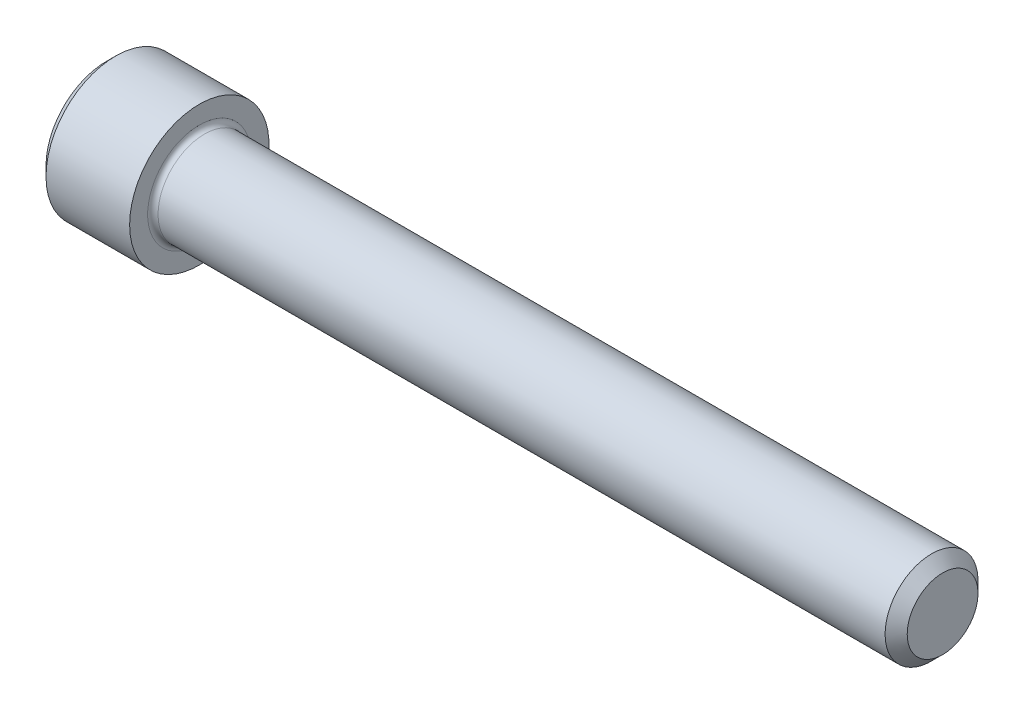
ISO-10303-21;
HEADER;
FILE_DESCRIPTION(('STEP AP214'),'2;1');
FILE_NAME('part.step','',(''),(''),'','','');
FILE_SCHEMA(('AUTOMOTIVE_DESIGN { 1 0 10303 214 1 1 1 1 }'));
ENDSEC;
DATA;
#1=APPLICATION_CONTEXT('core data for automotive mechanical design processes');
#2=APPLICATION_PROTOCOL_DEFINITION('international standard','automotive_design',2000,#1);
#3=PRODUCT_CONTEXT('',#1,'mechanical');
#4=PRODUCT('Part','Part','',(#3));
#5=PRODUCT_RELATED_PRODUCT_CATEGORY('part','',(#4));
#6=PRODUCT_DEFINITION_FORMATION('','',#4);
#7=PRODUCT_DEFINITION_CONTEXT('part definition',#1,'design');
#8=PRODUCT_DEFINITION('design','',#6,#7);
#9=PRODUCT_DEFINITION_SHAPE('','',#8);
#10=(LENGTH_UNIT() NAMED_UNIT(*) SI_UNIT(.MILLI.,.METRE.));
#11=(NAMED_UNIT(*) PLANE_ANGLE_UNIT() SI_UNIT($,.RADIAN.));
#12=(NAMED_UNIT(*) SI_UNIT($,.STERADIAN.) SOLID_ANGLE_UNIT());
#13=UNCERTAINTY_MEASURE_WITH_UNIT(LENGTH_MEASURE(1.E-05),#10,'distance_accuracy_value','');
#14=(GEOMETRIC_REPRESENTATION_CONTEXT(3) GLOBAL_UNCERTAINTY_ASSIGNED_CONTEXT((#13)) GLOBAL_UNIT_ASSIGNED_CONTEXT((#10,
#11,#12)) REPRESENTATION_CONTEXT('',''));
#15=CARTESIAN_POINT('',(0.,0.,0.));
#16=DIRECTION('',(0.,0.,1.));
#17=DIRECTION('',(1.,0.,0.));
#18=AXIS2_PLACEMENT_3D('',#15,#16,#17);
#19=CARTESIAN_POINT('',(0.,0.,0.));
#20=DIRECTION('',(-1.,0.,0.));
#21=DIRECTION('',(0.,0.,1.));
#22=AXIS2_PLACEMENT_3D('',#19,#20,#21);
#23=PLANE('',#22);
#24=DIRECTION('',(0.,-0.499999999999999,0.86602540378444));
#25=VECTOR('',#24,1.);
#26=CARTESIAN_POINT('',(0.,2.7496306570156,0.));
#27=LINE('',#26,#25);
#28=CARTESIAN_POINT('',(0.,2.7496306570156,0.));
#29=VERTEX_POINT('',#28);
#30=CARTESIAN_POINT('',(0.,1.3748153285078,2.38125));
#31=VERTEX_POINT('',#30);
#32=EDGE_CURVE('E376',#29,#31,#27,.T.);
#33=ORIENTED_EDGE('',*,*,#32,.T.);
#34=DIRECTION('',(0.,1.,0.));
#35=VECTOR('',#34,1.);
#36=CARTESIAN_POINT('',(0.,-1.37481532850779,2.38125));
#37=LINE('',#36,#35);
#38=CARTESIAN_POINT('',(0.,-1.37481532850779,2.38125));
#39=VERTEX_POINT('',#38);
#40=EDGE_CURVE('E124',#39,#31,#37,.T.);
#41=ORIENTED_EDGE('',*,*,#40,.F.);
#42=DIRECTION('',(0.,-0.500000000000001,-0.866025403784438));
#43=VECTOR('',#42,1.);
#44=CARTESIAN_POINT('',(0.,-1.37481532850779,2.38125));
#45=LINE('',#44,#43);
#46=CARTESIAN_POINT('',(0.,-2.74963065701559,0.));
#47=VERTEX_POINT('',#46);
#48=EDGE_CURVE('E379',#39,#47,#45,.T.);
#49=ORIENTED_EDGE('',*,*,#48,.T.);
#50=DIRECTION('',(0.,0.499999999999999,-0.866025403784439));
#51=VECTOR('',#50,1.);
#52=CARTESIAN_POINT('',(0.,-2.74963065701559,0.));
#53=LINE('',#52,#51);
#54=CARTESIAN_POINT('',(0.,-1.3748153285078,-2.38125));
#55=VERTEX_POINT('',#54);
#56=EDGE_CURVE('E382',#47,#55,#53,.T.);
#57=ORIENTED_EDGE('',*,*,#56,.T.);
#58=DIRECTION('',(0.,-1.,0.));
#59=VECTOR('',#58,1.);
#60=CARTESIAN_POINT('',(0.,1.3748153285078,-2.38125));
#61=LINE('',#60,#59);
#62=CARTESIAN_POINT('',(0.,1.3748153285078,-2.38125));
#63=VERTEX_POINT('',#62);
#64=EDGE_CURVE('E385',#63,#55,#61,.T.);
#65=ORIENTED_EDGE('',*,*,#64,.F.);
#66=DIRECTION('',(0.,-0.500000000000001,-0.866025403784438));
#67=VECTOR('',#66,1.);
#68=CARTESIAN_POINT('',(0.,2.7496306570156,0.));
#69=LINE('',#68,#67);
#70=EDGE_CURVE('E119',#29,#63,#69,.T.);
#71=ORIENTED_EDGE('',*,*,#70,.F.);
#72=EDGE_LOOP('',(#33,#41,#49,#57,#65,#71));
#73=FACE_BOUND('',#72,.T.);
#74=CARTESIAN_POINT('',(0.,0.,0.));
#75=DIRECTION('',(-1.,0.,0.));
#76=DIRECTION('',(0.,0.,1.));
#77=AXIS2_PLACEMENT_3D('',#74,#75,#76);
#78=CIRCLE('',#77,4.12750000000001);
#79=CARTESIAN_POINT('',(0.,0.,4.12750000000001));
#80=VERTEX_POINT('',#79);
#81=EDGE_CURVE('E135',#80,#80,#78,.T.);
#82=ORIENTED_EDGE('',*,*,#81,.T.);
#83=EDGE_LOOP('',(#82));
#84=FACE_BOUND('',#83,.T.);
#85=ADVANCED_FACE('F32',(#73,#84),#23,.T.);
#86=CARTESIAN_POINT('',(57.15,2.41935,0.));
#87=DIRECTION('',(1.,0.,0.));
#88=DIRECTION('',(0.,0.,-1.));
#89=AXIS2_PLACEMENT_3D('',#86,#87,#88);
#90=PLANE('',#89);
#91=CARTESIAN_POINT('',(57.15,0.,0.));
#92=DIRECTION('',(-1.,0.,0.));
#93=DIRECTION('',(0.,0.,1.));
#94=AXIS2_PLACEMENT_3D('',#91,#92,#93);
#95=CIRCLE('',#94,2.41935);
#96=CARTESIAN_POINT('',(57.15,0.,2.41935));
#97=VERTEX_POINT('',#96);
#98=EDGE_CURVE('E148',#97,#97,#95,.T.);
#99=ORIENTED_EDGE('',*,*,#98,.F.);
#100=EDGE_LOOP('',(#99));
#101=FACE_BOUND('',#100,.T.);
#102=ADVANCED_FACE('F169',(#101),#90,.T.);
#103=CARTESIAN_POINT('',(57.15,0.,0.));
#104=DIRECTION('',(-1.,0.,0.));
#105=DIRECTION('',(0.,0.,1.));
#106=AXIS2_PLACEMENT_3D('',#103,#104,#105);
#107=CONICAL_SURFACE('',#106,2.41935,0.78539816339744);
#108=CARTESIAN_POINT('',(56.39435,0.,0.));
#109=DIRECTION('',(-1.,0.,0.));
#110=DIRECTION('',(0.,0.,1.));
#111=AXIS2_PLACEMENT_3D('',#108,#109,#110);
#112=CIRCLE('',#111,3.175);
#113=CARTESIAN_POINT('',(56.39435,0.,3.175));
#114=VERTEX_POINT('',#113);
#115=EDGE_CURVE('E145',#114,#114,#112,.T.);
#116=ORIENTED_EDGE('',*,*,#115,.F.);
#117=EDGE_LOOP('',(#116));
#118=FACE_BOUND('',#117,.T.);
#119=ORIENTED_EDGE('',*,*,#98,.T.);
#120=EDGE_LOOP('',(#119));
#121=FACE_BOUND('',#120,.T.);
#122=ADVANCED_FACE('F175',(#118,#121),#107,.T.);
#123=CARTESIAN_POINT('',(-31.75,0.,0.));
#124=DIRECTION('',(-1.,0.,0.));
#125=DIRECTION('',(0.,0.,1.));
#126=AXIS2_PLACEMENT_3D('',#123,#124,#125);
#127=CYLINDRICAL_SURFACE('',#126,3.175);
#128=CARTESIAN_POINT('',(6.70560000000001,0.,0.));
#129=DIRECTION('',(1.,0.,0.));
#130=DIRECTION('',(0.,0.,-1.));
#131=AXIS2_PLACEMENT_3D('',#128,#129,#130);
#132=CIRCLE('',#131,3.175);
#133=CARTESIAN_POINT('',(6.70560000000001,0.,-3.175));
#134=VERTEX_POINT('',#133);
#135=EDGE_CURVE('E11',#134,#134,#132,.T.);
#136=ORIENTED_EDGE('',*,*,#135,.T.);
#137=EDGE_LOOP('',(#136));
#138=FACE_BOUND('',#137,.T.);
#139=ORIENTED_EDGE('',*,*,#115,.T.);
#140=EDGE_LOOP('',(#139));
#141=FACE_BOUND('',#140,.T.);
#142=ADVANCED_FACE('F186',(#138,#141),#127,.T.);
#143=CARTESIAN_POINT('',(6.35,4.7625,0.));
#144=DIRECTION('',(1.,0.,0.));
#145=DIRECTION('',(0.,0.,-1.));
#146=AXIS2_PLACEMENT_3D('',#143,#144,#145);
#147=PLANE('',#146);
#148=CARTESIAN_POINT('',(6.35,0.,0.));
#149=DIRECTION('',(1.,0.,0.));
#150=DIRECTION('',(0.,0.,-1.));
#151=AXIS2_PLACEMENT_3D('',#148,#149,#150);
#152=CIRCLE('',#151,3.5306);
#153=CARTESIAN_POINT('',(6.35,0.,-3.5306));
#154=VERTEX_POINT('',#153);
#155=EDGE_CURVE('E40',#154,#154,#152,.F.);
#156=ORIENTED_EDGE('',*,*,#155,.T.);
#157=EDGE_LOOP('',(#156));
#158=FACE_BOUND('',#157,.T.);
#159=CARTESIAN_POINT('',(6.35000000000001,0.,0.));
#160=DIRECTION('',(-1.,0.,0.));
#161=DIRECTION('',(0.,0.,1.));
#162=AXIS2_PLACEMENT_3D('',#159,#160,#161);
#163=CIRCLE('',#162,4.7625);
#164=CARTESIAN_POINT('',(6.35000000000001,0.,4.7625));
#165=VERTEX_POINT('',#164);
#166=EDGE_CURVE('E142',#165,#165,#163,.T.);
#167=ORIENTED_EDGE('',*,*,#166,.F.);
#168=EDGE_LOOP('',(#167));
#169=FACE_BOUND('',#168,.T.);
#170=ADVANCED_FACE('F153',(#158,#169),#147,.T.);
#171=CARTESIAN_POINT('',(-31.75,0.,0.));
#172=DIRECTION('',(-1.,0.,0.));
#173=DIRECTION('',(0.,0.,1.));
#174=AXIS2_PLACEMENT_3D('',#171,#172,#173);
#175=CYLINDRICAL_SURFACE('',#174,4.7625);
#176=ORIENTED_EDGE('',*,*,#166,.T.);
#177=EDGE_LOOP('',(#176));
#178=FACE_BOUND('',#177,.T.);
#179=CARTESIAN_POINT('',(0.635000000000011,0.,0.));
#180=DIRECTION('',(-1.,0.,0.));
#181=DIRECTION('',(0.,0.,1.));
#182=AXIS2_PLACEMENT_3D('',#179,#180,#181);
#183=CIRCLE('',#182,4.7625);
#184=CARTESIAN_POINT('',(0.635000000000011,0.,4.7625));
#185=VERTEX_POINT('',#184);
#186=EDGE_CURVE('E139',#185,#185,#183,.T.);
#187=ORIENTED_EDGE('',*,*,#186,.F.);
#188=EDGE_LOOP('',(#187));
#189=FACE_BOUND('',#188,.T.);
#190=ADVANCED_FACE('F164',(#178,#189),#175,.T.);
#191=CARTESIAN_POINT('',(0.,0.,0.));
#192=DIRECTION('',(1.,0.,0.));
#193=DIRECTION('',(0.,0.,-1.));
#194=AXIS2_PLACEMENT_3D('',#191,#192,#193);
#195=CONICAL_SURFACE('',#194,4.12750000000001,0.785398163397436);
#196=ORIENTED_EDGE('',*,*,#186,.T.);
#197=EDGE_LOOP('',(#196));
#198=FACE_BOUND('',#197,.T.);
#199=ORIENTED_EDGE('',*,*,#81,.F.);
#200=EDGE_LOOP('',(#199));
#201=FACE_BOUND('',#200,.T.);
#202=ADVANCED_FACE('F157',(#198,#201),#195,.T.);
#203=CARTESIAN_POINT('',(6.70560000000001,0.,0.));
#204=DIRECTION('',(1.,0.,0.));
#205=DIRECTION('',(0.,0.,-1.));
#206=AXIS2_PLACEMENT_3D('',#203,#204,#205);
#207=TOROIDAL_SURFACE('',#206,3.5306,0.3556);
#208=ORIENTED_EDGE('',*,*,#135,.F.);
#209=EDGE_LOOP('',(#208));
#210=FACE_BOUND('',#209,.T.);
#211=ORIENTED_EDGE('',*,*,#155,.F.);
#212=EDGE_LOOP('',(#211));
#213=FACE_BOUND('',#212,.T.);
#214=ADVANCED_FACE('F34',(#210,#213),#207,.F.);
#215=CARTESIAN_POINT('',(3.048,2.7496306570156,0.));
#216=DIRECTION('',(0.,-0.86602540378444,-0.499999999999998));
#217=DIRECTION('',(0.,0.499999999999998,-0.86602540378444));
#218=AXIS2_PLACEMENT_3D('',#215,#216,#217);
#219=PLANE('',#218);
#220=ORIENTED_EDGE('',*,*,#32,.F.);
#221=DIRECTION('',(-1.,0.,0.));
#222=VECTOR('',#221,1.);
#223=CARTESIAN_POINT('',(3.048,2.7496306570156,0.));
#224=LINE('',#223,#222);
#225=CARTESIAN_POINT('',(3.048,2.7496306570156,0.));
#226=VERTEX_POINT('',#225);
#227=EDGE_CURVE('E375',#226,#29,#224,.T.);
#228=ORIENTED_EDGE('',*,*,#227,.F.);
#229=DIRECTION('',(0.,-0.499999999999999,0.86602540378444));
#230=VECTOR('',#229,1.);
#231=CARTESIAN_POINT('',(3.048,2.7496306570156,0.));
#232=LINE('',#231,#230);
#233=CARTESIAN_POINT('',(3.04800000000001,2.0622229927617,1.190625));
#234=VERTEX_POINT('',#233);
#235=EDGE_CURVE('E47',#226,#234,#232,.T.);
#236=ORIENTED_EDGE('',*,*,#235,.T.);
#237=CARTESIAN_POINT('',(3.048,1.3748153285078,2.38125));
#238=VERTEX_POINT('',#237);
#239=EDGE_CURVE('E105',#234,#238,#232,.T.);
#240=ORIENTED_EDGE('',*,*,#239,.T.);
#241=DIRECTION('',(-1.,0.,0.));
#242=VECTOR('',#241,1.);
#243=CARTESIAN_POINT('',(3.048,1.3748153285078,2.38125));
#244=LINE('',#243,#242);
#245=EDGE_CURVE('E117',#238,#31,#244,.T.);
#246=ORIENTED_EDGE('',*,*,#245,.T.);
#247=EDGE_LOOP('',(#220,#228,#236,#240,#246));
#248=FACE_BOUND('',#247,.T.);
#249=ADVANCED_FACE('F116',(#248),#219,.T.);
#250=CARTESIAN_POINT('',(3.048,-1.37481532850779,2.38125));
#251=DIRECTION('',(0.,0.,1.));
#252=DIRECTION('',(0.,-1.,0.));
#253=AXIS2_PLACEMENT_3D('',#250,#251,#252);
#254=PLANE('',#253);
#255=ORIENTED_EDGE('',*,*,#40,.T.);
#256=ORIENTED_EDGE('',*,*,#245,.F.);
#257=DIRECTION('',(0.,1.,0.));
#258=VECTOR('',#257,1.);
#259=CARTESIAN_POINT('',(3.048,-1.37481532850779,2.38125));
#260=LINE('',#259,#258);
#261=CARTESIAN_POINT('',(3.048,0.,2.38125));
#262=VERTEX_POINT('',#261);
#263=EDGE_CURVE('E103',#262,#238,#260,.T.);
#264=ORIENTED_EDGE('',*,*,#263,.F.);
#265=CARTESIAN_POINT('',(3.048,-1.37481532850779,2.38125));
#266=VERTEX_POINT('',#265);
#267=EDGE_CURVE('E113',#266,#262,#260,.T.);
#268=ORIENTED_EDGE('',*,*,#267,.F.);
#269=DIRECTION('',(-1.,0.,0.));
#270=VECTOR('',#269,1.);
#271=CARTESIAN_POINT('',(3.048,-1.37481532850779,2.38125));
#272=LINE('',#271,#270);
#273=EDGE_CURVE('E126',#266,#39,#272,.T.);
#274=ORIENTED_EDGE('',*,*,#273,.T.);
#275=EDGE_LOOP('',(#255,#256,#264,#268,#274));
#276=FACE_BOUND('',#275,.T.);
#277=ADVANCED_FACE('F121',(#276),#254,.F.);
#278=CARTESIAN_POINT('',(3.048,-1.37481532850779,2.38125));
#279=DIRECTION('',(0.,0.866025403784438,-0.500000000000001));
#280=DIRECTION('',(0.,0.500000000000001,0.866025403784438));
#281=AXIS2_PLACEMENT_3D('',#278,#279,#280);
#282=PLANE('',#281);
#283=ORIENTED_EDGE('',*,*,#48,.F.);
#284=ORIENTED_EDGE('',*,*,#273,.F.);
#285=DIRECTION('',(0.,-0.500000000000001,-0.866025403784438));
#286=VECTOR('',#285,1.);
#287=CARTESIAN_POINT('',(3.048,-1.37481532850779,2.38125));
#288=LINE('',#287,#286);
#289=CARTESIAN_POINT('',(3.048,-2.06222299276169,1.190625));
#290=VERTEX_POINT('',#289);
#291=EDGE_CURVE('E356',#266,#290,#288,.T.);
#292=ORIENTED_EDGE('',*,*,#291,.T.);
#293=CARTESIAN_POINT('',(3.048,-2.74963065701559,0.));
#294=VERTEX_POINT('',#293);
#295=EDGE_CURVE('E358',#290,#294,#288,.T.);
#296=ORIENTED_EDGE('',*,*,#295,.T.);
#297=DIRECTION('',(-1.,0.,0.));
#298=VECTOR('',#297,1.);
#299=CARTESIAN_POINT('',(3.048,-2.74963065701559,0.));
#300=LINE('',#299,#298);
#301=EDGE_CURVE('E131',#294,#47,#300,.T.);
#302=ORIENTED_EDGE('',*,*,#301,.T.);
#303=EDGE_LOOP('',(#283,#284,#292,#296,#302));
#304=FACE_BOUND('',#303,.T.);
#305=ADVANCED_FACE('F248',(#304),#282,.T.);
#306=CARTESIAN_POINT('',(3.048,-2.74963065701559,0.));
#307=DIRECTION('',(0.,0.866025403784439,0.499999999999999));
#308=DIRECTION('',(0.,-0.499999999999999,0.866025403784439));
#309=AXIS2_PLACEMENT_3D('',#306,#307,#308);
#310=PLANE('',#309);
#311=ORIENTED_EDGE('',*,*,#56,.F.);
#312=ORIENTED_EDGE('',*,*,#301,.F.);
#313=DIRECTION('',(0.,0.499999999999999,-0.866025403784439));
#314=VECTOR('',#313,1.);
#315=CARTESIAN_POINT('',(3.048,-2.74963065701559,0.));
#316=LINE('',#315,#314);
#317=CARTESIAN_POINT('',(3.048,-2.06222299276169,-1.190625));
#318=VERTEX_POINT('',#317);
#319=EDGE_CURVE('E361',#294,#318,#316,.T.);
#320=ORIENTED_EDGE('',*,*,#319,.T.);
#321=CARTESIAN_POINT('',(3.048,-1.3748153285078,-2.38125));
#322=VERTEX_POINT('',#321);
#323=EDGE_CURVE('E365',#318,#322,#316,.T.);
#324=ORIENTED_EDGE('',*,*,#323,.T.);
#325=DIRECTION('',(-1.,0.,0.));
#326=VECTOR('',#325,1.);
#327=CARTESIAN_POINT('',(3.048,-1.3748153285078,-2.38125));
#328=LINE('',#327,#326);
#329=EDGE_CURVE('E394',#322,#55,#328,.T.);
#330=ORIENTED_EDGE('',*,*,#329,.T.);
#331=EDGE_LOOP('',(#311,#312,#320,#324,#330));
#332=FACE_BOUND('',#331,.T.);
#333=ADVANCED_FACE('F256',(#332),#310,.T.);
#334=CARTESIAN_POINT('',(3.048,1.3748153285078,-2.38125));
#335=DIRECTION('',(0.,0.,-1.));
#336=DIRECTION('',(0.,1.,0.));
#337=AXIS2_PLACEMENT_3D('',#334,#335,#336);
#338=PLANE('',#337);
#339=ORIENTED_EDGE('',*,*,#64,.T.);
#340=ORIENTED_EDGE('',*,*,#329,.F.);
#341=DIRECTION('',(0.,-1.,0.));
#342=VECTOR('',#341,1.);
#343=CARTESIAN_POINT('',(3.048,1.3748153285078,-2.38125));
#344=LINE('',#343,#342);
#345=CARTESIAN_POINT('',(3.048,0.,-2.38125));
#346=VERTEX_POINT('',#345);
#347=EDGE_CURVE('E369',#346,#322,#344,.T.);
#348=ORIENTED_EDGE('',*,*,#347,.F.);
#349=CARTESIAN_POINT('',(3.048,1.3748153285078,-2.38125));
#350=VERTEX_POINT('',#349);
#351=EDGE_CURVE('E370',#350,#346,#344,.T.);
#352=ORIENTED_EDGE('',*,*,#351,.F.);
#353=DIRECTION('',(-1.,0.,0.));
#354=VECTOR('',#353,1.);
#355=CARTESIAN_POINT('',(3.048,1.3748153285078,-2.38125));
#356=LINE('',#355,#354);
#357=EDGE_CURVE('E391',#350,#63,#356,.T.);
#358=ORIENTED_EDGE('',*,*,#357,.T.);
#359=EDGE_LOOP('',(#339,#340,#348,#352,#358));
#360=FACE_BOUND('',#359,.T.);
#361=ADVANCED_FACE('F265',(#360),#338,.F.);
#362=CARTESIAN_POINT('',(3.048,2.7496306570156,0.));
#363=DIRECTION('',(0.,0.866025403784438,-0.500000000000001));
#364=DIRECTION('',(0.,0.500000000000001,0.866025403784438));
#365=AXIS2_PLACEMENT_3D('',#362,#363,#364);
#366=PLANE('',#365);
#367=ORIENTED_EDGE('',*,*,#70,.T.);
#368=ORIENTED_EDGE('',*,*,#357,.F.);
#369=DIRECTION('',(0.,-0.500000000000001,-0.866025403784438));
#370=VECTOR('',#369,1.);
#371=CARTESIAN_POINT('',(3.048,2.7496306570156,0.));
#372=LINE('',#371,#370);
#373=CARTESIAN_POINT('',(3.048,2.0622229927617,-1.19062500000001));
#374=VERTEX_POINT('',#373);
#375=EDGE_CURVE('E373',#374,#350,#372,.T.);
#376=ORIENTED_EDGE('',*,*,#375,.F.);
#377=EDGE_CURVE('E347',#226,#374,#372,.T.);
#378=ORIENTED_EDGE('',*,*,#377,.F.);
#379=ORIENTED_EDGE('',*,*,#227,.T.);
#380=EDGE_LOOP('',(#367,#368,#376,#378,#379));
#381=FACE_BOUND('',#380,.T.);
#382=ADVANCED_FACE('F274',(#381),#366,.F.);
#383=CARTESIAN_POINT('',(3.048,1.3748153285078,2.38125));
#384=DIRECTION('',(-1.,0.,0.));
#385=DIRECTION('',(0.,0.,1.));
#386=AXIS2_PLACEMENT_3D('',#383,#384,#385);
#387=PLANE('',#386);
#388=CARTESIAN_POINT('',(3.04800000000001,0.,0.));
#389=DIRECTION('',(-1.,0.,0.));
#390=DIRECTION('',(0.,0.,1.));
#391=AXIS2_PLACEMENT_3D('',#388,#389,#390);
#392=CIRCLE('',#391,2.38125);
#393=EDGE_CURVE('E125',#290,#262,#392,.T.);
#394=ORIENTED_EDGE('',*,*,#393,.F.);
#395=ORIENTED_EDGE('',*,*,#291,.F.);
#396=ORIENTED_EDGE('',*,*,#267,.T.);
#397=EDGE_LOOP('',(#394,#395,#396));
#398=FACE_BOUND('',#397,.T.);
#399=ADVANCED_FACE('F283',(#398),#387,.T.);
#400=EDGE_CURVE('E129',#318,#290,#392,.T.);
#401=ORIENTED_EDGE('',*,*,#400,.F.);
#402=ORIENTED_EDGE('',*,*,#319,.F.);
#403=ORIENTED_EDGE('',*,*,#295,.F.);
#404=EDGE_LOOP('',(#401,#402,#403));
#405=FACE_BOUND('',#404,.T.);
#406=ADVANCED_FACE('F292',(#405),#387,.T.);
#407=EDGE_CURVE('E400',#346,#318,#392,.T.);
#408=ORIENTED_EDGE('',*,*,#407,.F.);
#409=ORIENTED_EDGE('',*,*,#347,.T.);
#410=ORIENTED_EDGE('',*,*,#323,.F.);
#411=EDGE_LOOP('',(#408,#409,#410));
#412=FACE_BOUND('',#411,.T.);
#413=ADVANCED_FACE('F301',(#412),#387,.T.);
#414=EDGE_CURVE('E350',#374,#346,#392,.T.);
#415=ORIENTED_EDGE('',*,*,#414,.F.);
#416=ORIENTED_EDGE('',*,*,#375,.T.);
#417=ORIENTED_EDGE('',*,*,#351,.T.);
#418=EDGE_LOOP('',(#415,#416,#417));
#419=FACE_BOUND('',#418,.T.);
#420=ADVANCED_FACE('F309',(#419),#387,.T.);
#421=EDGE_CURVE('E136',#234,#374,#392,.T.);
#422=ORIENTED_EDGE('',*,*,#421,.F.);
#423=ORIENTED_EDGE('',*,*,#235,.F.);
#424=ORIENTED_EDGE('',*,*,#377,.T.);
#425=EDGE_LOOP('',(#422,#423,#424));
#426=FACE_BOUND('',#425,.T.);
#427=ADVANCED_FACE('F317',(#426),#387,.T.);
#428=EDGE_CURVE('E108',#262,#234,#392,.T.);
#429=ORIENTED_EDGE('',*,*,#428,.F.);
#430=ORIENTED_EDGE('',*,*,#263,.T.);
#431=ORIENTED_EDGE('',*,*,#239,.F.);
#432=EDGE_LOOP('',(#429,#430,#431));
#433=FACE_BOUND('',#432,.T.);
#434=ADVANCED_FACE('F104',(#433),#387,.T.);
#435=CARTESIAN_POINT('',(3.04800000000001,0.,0.));
#436=DIRECTION('',(-1.,0.,0.));
#437=DIRECTION('',(0.,0.,1.));
#438=AXIS2_PLACEMENT_3D('',#435,#436,#437);
#439=CONICAL_SURFACE('',#438,2.38125,1.04719755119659);
#440=CARTESIAN_POINT('',(4.42281532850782,0.,0.));
#441=VERTEX_POINT('',#440);
#442=VERTEX_LOOP('',#441);
#443=FACE_BOUND('',#442,.T.);
#444=ORIENTED_EDGE('',*,*,#428,.T.);
#445=ORIENTED_EDGE('',*,*,#421,.T.);
#446=ORIENTED_EDGE('',*,*,#414,.T.);
#447=ORIENTED_EDGE('',*,*,#407,.T.);
#448=ORIENTED_EDGE('',*,*,#400,.T.);
#449=ORIENTED_EDGE('',*,*,#393,.T.);
#450=EDGE_LOOP('',(#444,#445,#446,#447,#448,#449));
#451=FACE_BOUND('',#450,.T.);
#452=ADVANCED_FACE('F179',(#443,#451),#439,.F.);
#453=CLOSED_SHELL('',(#85,#102,#122,#142,#170,#190,#202,#214,#249,#277,#305,#333,#361,#382,#399,
#406,#413,#420,#427,#434,#452));
#454=MANIFOLD_SOLID_BREP('B2',#453);
#455=ADVANCED_BREP_SHAPE_REPRESENTATION('',(#18,#454),#14);
#456=SHAPE_DEFINITION_REPRESENTATION(#9,#455);
ENDSEC;
END-ISO-10303-21;
